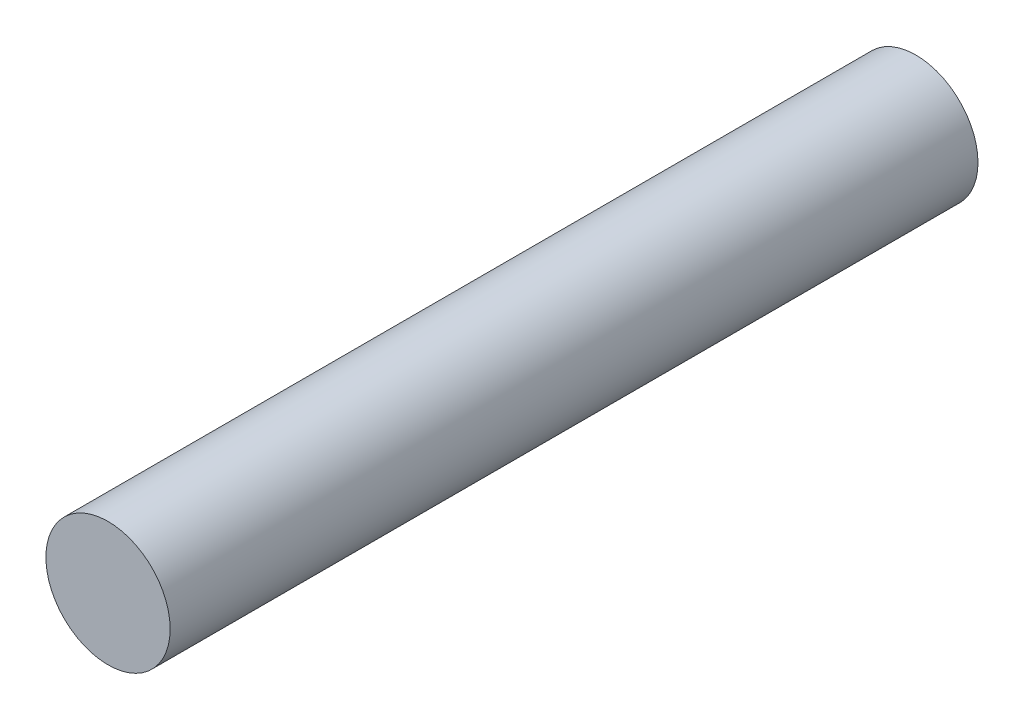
from build123d import *

# Parameters (mm, degrees)
EXTRUDE1_DEPTH      = 12.7
EXTRUDE1_DEPTH_BACK = 152.4
SKETCH1_R           = 12.7


with BuildPart() as part:
    # Sketch1 → Extrude1 (new, two sides: drawn at the far end of the back side and taken through both)
    with BuildSketch(Plane.XY.offset(-EXTRUDE1_DEPTH_BACK)):
        Circle(SKETCH1_R)
    extrude(amount=EXTRUDE1_DEPTH + EXTRUDE1_DEPTH_BACK)


solid = part.part
